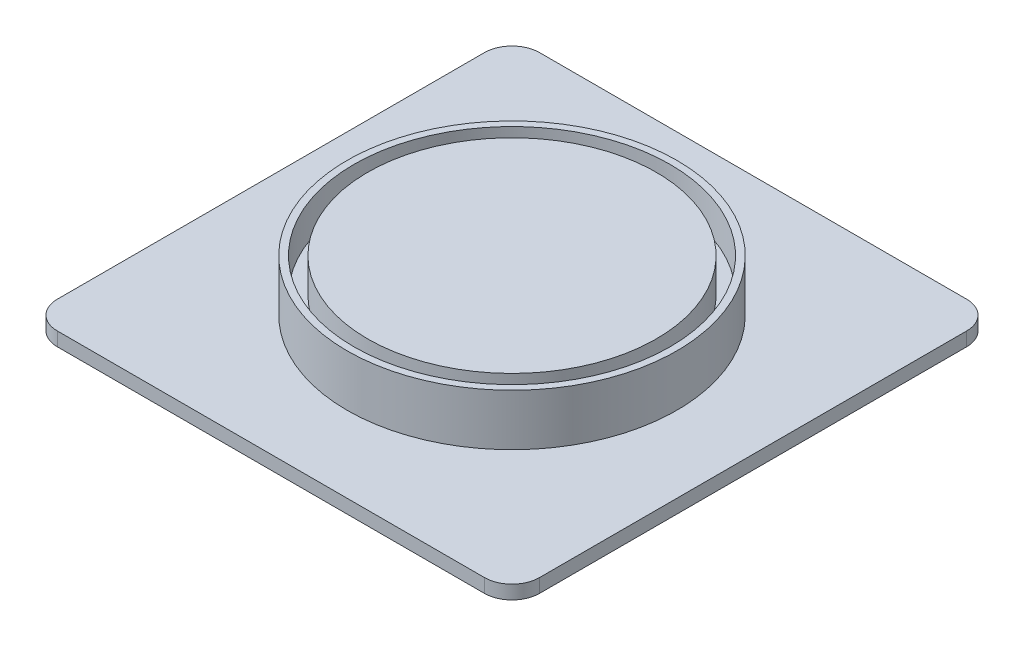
ISO-10303-21;
HEADER;
FILE_DESCRIPTION(('STEP AP214'),'2;1');
FILE_NAME('part.step','',(''),(''),'','','');
FILE_SCHEMA(('AUTOMOTIVE_DESIGN { 1 0 10303 214 1 1 1 1 }'));
ENDSEC;
DATA;
#1=APPLICATION_CONTEXT('core data for automotive mechanical design processes');
#2=APPLICATION_PROTOCOL_DEFINITION('international standard','automotive_design',2000,#1);
#3=PRODUCT_CONTEXT('',#1,'mechanical');
#4=PRODUCT('Part','Part','',(#3));
#5=PRODUCT_RELATED_PRODUCT_CATEGORY('part','',(#4));
#6=PRODUCT_DEFINITION_FORMATION('','',#4);
#7=PRODUCT_DEFINITION_CONTEXT('part definition',#1,'design');
#8=PRODUCT_DEFINITION('design','',#6,#7);
#9=PRODUCT_DEFINITION_SHAPE('','',#8);
#10=(LENGTH_UNIT() NAMED_UNIT(*) SI_UNIT(.MILLI.,.METRE.));
#11=(NAMED_UNIT(*) PLANE_ANGLE_UNIT() SI_UNIT($,.RADIAN.));
#12=(NAMED_UNIT(*) SI_UNIT($,.STERADIAN.) SOLID_ANGLE_UNIT());
#13=UNCERTAINTY_MEASURE_WITH_UNIT(LENGTH_MEASURE(1.E-05),#10,'distance_accuracy_value','');
#14=(GEOMETRIC_REPRESENTATION_CONTEXT(3) GLOBAL_UNCERTAINTY_ASSIGNED_CONTEXT((#13)) GLOBAL_UNIT_ASSIGNED_CONTEXT((#10,
#11,#12)) REPRESENTATION_CONTEXT('',''));
#15=CARTESIAN_POINT('',(0.,0.,0.));
#16=DIRECTION('',(0.,0.,1.));
#17=DIRECTION('',(1.,0.,0.));
#18=AXIS2_PLACEMENT_3D('',#15,#16,#17);
#19=CARTESIAN_POINT('',(0.,37.4682,0.));
#20=DIRECTION('',(0.,-1.,0.));
#21=DIRECTION('',(0.,0.,-1.));
#22=AXIS2_PLACEMENT_3D('',#19,#20,#21);
#23=CYLINDRICAL_SURFACE('',#22,120.);
#24=CARTESIAN_POINT('',(0.,37.4682,0.));
#25=DIRECTION('',(0.,1.,0.));
#26=DIRECTION('',(0.,0.,1.));
#27=AXIS2_PLACEMENT_3D('',#24,#25,#26);
#28=CIRCLE('',#27,120.);
#29=CARTESIAN_POINT('',(0.,37.4682,120.));
#30=VERTEX_POINT('',#29);
#31=EDGE_CURVE('E125',#30,#30,#28,.T.);
#32=ORIENTED_EDGE('',*,*,#31,.F.);
#33=EDGE_LOOP('',(#32));
#34=FACE_BOUND('',#33,.T.);
#35=CARTESIAN_POINT('',(0.,0.,0.));
#36=DIRECTION('',(0.,-1.,0.));
#37=DIRECTION('',(0.,0.,-1.));
#38=AXIS2_PLACEMENT_3D('',#35,#36,#37);
#39=CIRCLE('',#38,120.);
#40=CARTESIAN_POINT('',(0.,0.,-120.));
#41=VERTEX_POINT('',#40);
#42=EDGE_CURVE('E129',#41,#41,#39,.T.);
#43=ORIENTED_EDGE('',*,*,#42,.F.);
#44=EDGE_LOOP('',(#43));
#45=FACE_BOUND('',#44,.T.);
#46=ADVANCED_FACE('F34',(#34,#45),#23,.T.);
#47=CARTESIAN_POINT('',(0.,37.4682,0.));
#48=DIRECTION('',(0.,1.,0.));
#49=DIRECTION('',(0.,0.,1.));
#50=AXIS2_PLACEMENT_3D('',#47,#48,#49);
#51=PLANE('',#50);
#52=CARTESIAN_POINT('',(0.,37.4682,0.));
#53=DIRECTION('',(0.,1.,0.));
#54=DIRECTION('',(0.,0.,1.));
#55=AXIS2_PLACEMENT_3D('',#52,#53,#54);
#56=CIRCLE('',#55,115.);
#57=CARTESIAN_POINT('',(0.,37.4682,115.));
#58=VERTEX_POINT('',#57);
#59=EDGE_CURVE('E214',#58,#58,#56,.T.);
#60=ORIENTED_EDGE('',*,*,#59,.F.);
#61=EDGE_LOOP('',(#60));
#62=FACE_BOUND('',#61,.T.);
#63=ORIENTED_EDGE('',*,*,#31,.T.);
#64=EDGE_LOOP('',(#63));
#65=FACE_BOUND('',#64,.T.);
#66=ADVANCED_FACE('F175',(#62,#65),#51,.T.);
#67=CARTESIAN_POINT('',(175.4,0.,-175.4));
#68=DIRECTION('',(0.,-1.,0.));
#69=DIRECTION('',(0.,0.,-1.));
#70=AXIS2_PLACEMENT_3D('',#67,#68,#69);
#71=PLANE('',#70);
#72=DIRECTION('',(1.,0.,0.));
#73=VECTOR('',#72,1.);
#74=CARTESIAN_POINT('',(-175.4,0.,175.4));
#75=LINE('',#74,#73);
#76=CARTESIAN_POINT('',(-155.4,0.,175.4));
#77=VERTEX_POINT('',#76);
#78=CARTESIAN_POINT('',(155.4,0.,175.4));
#79=VERTEX_POINT('',#78);
#80=EDGE_CURVE('E104',#77,#79,#75,.T.);
#81=ORIENTED_EDGE('',*,*,#80,.T.);
#82=CARTESIAN_POINT('',(155.4,0.,155.4));
#83=DIRECTION('',(0.,-1.,0.));
#84=DIRECTION('',(0.,0.,-1.));
#85=AXIS2_PLACEMENT_3D('',#82,#83,#84);
#86=CIRCLE('',#85,20.);
#87=CARTESIAN_POINT('',(175.4,0.,155.4));
#88=VERTEX_POINT('',#87);
#89=EDGE_CURVE('E136',#79,#88,#86,.F.);
#90=ORIENTED_EDGE('',*,*,#89,.T.);
#91=DIRECTION('',(0.,0.,-1.));
#92=VECTOR('',#91,1.);
#93=CARTESIAN_POINT('',(175.4,0.,175.4));
#94=LINE('',#93,#92);
#95=CARTESIAN_POINT('',(175.4,0.,-155.4));
#96=VERTEX_POINT('',#95);
#97=EDGE_CURVE('E164',#88,#96,#94,.T.);
#98=ORIENTED_EDGE('',*,*,#97,.T.);
#99=CARTESIAN_POINT('',(155.4,0.,-155.4));
#100=DIRECTION('',(0.,-1.,0.));
#101=DIRECTION('',(0.,0.,-1.));
#102=AXIS2_PLACEMENT_3D('',#99,#100,#101);
#103=CIRCLE('',#102,20.);
#104=CARTESIAN_POINT('',(155.4,0.,-175.4));
#105=VERTEX_POINT('',#104);
#106=EDGE_CURVE('E134',#96,#105,#103,.F.);
#107=ORIENTED_EDGE('',*,*,#106,.T.);
#108=DIRECTION('',(-1.,0.,0.));
#109=VECTOR('',#108,1.);
#110=CARTESIAN_POINT('',(-175.4,0.,-175.4));
#111=LINE('',#110,#109);
#112=CARTESIAN_POINT('',(-155.4,0.,-175.4));
#113=VERTEX_POINT('',#112);
#114=EDGE_CURVE('E167',#105,#113,#111,.T.);
#115=ORIENTED_EDGE('',*,*,#114,.T.);
#116=CARTESIAN_POINT('',(-155.4,0.,-155.4));
#117=DIRECTION('',(0.,-1.,0.));
#118=DIRECTION('',(0.,0.,-1.));
#119=AXIS2_PLACEMENT_3D('',#116,#117,#118);
#120=CIRCLE('',#119,20.);
#121=CARTESIAN_POINT('',(-175.4,0.,-155.4));
#122=VERTEX_POINT('',#121);
#123=EDGE_CURVE('E111',#113,#122,#120,.F.);
#124=ORIENTED_EDGE('',*,*,#123,.T.);
#125=DIRECTION('',(0.,0.,1.));
#126=VECTOR('',#125,1.);
#127=CARTESIAN_POINT('',(-175.4,0.,175.4));
#128=LINE('',#127,#126);
#129=CARTESIAN_POINT('',(-175.4,0.,155.4));
#130=VERTEX_POINT('',#129);
#131=EDGE_CURVE('E106',#122,#130,#128,.T.);
#132=ORIENTED_EDGE('',*,*,#131,.T.);
#133=CARTESIAN_POINT('',(-155.4,0.,155.4));
#134=DIRECTION('',(0.,-1.,0.));
#135=DIRECTION('',(0.,0.,-1.));
#136=AXIS2_PLACEMENT_3D('',#133,#134,#135);
#137=CIRCLE('',#136,20.);
#138=EDGE_CURVE('E100',#130,#77,#137,.F.);
#139=ORIENTED_EDGE('',*,*,#138,.T.);
#140=EDGE_LOOP('',(#81,#90,#98,#107,#115,#124,#132,#139));
#141=FACE_BOUND('',#140,.T.);
#142=ORIENTED_EDGE('',*,*,#42,.T.);
#143=EDGE_LOOP('',(#142));
#144=FACE_BOUND('',#143,.T.);
#145=ADVANCED_FACE('F102',(#141,#144),#71,.F.);
#146=CARTESIAN_POINT('',(175.4,-10.,175.4));
#147=DIRECTION('',(1.,0.,0.));
#148=DIRECTION('',(0.,0.,-1.));
#149=AXIS2_PLACEMENT_3D('',#146,#147,#148);
#150=PLANE('',#149);
#151=ORIENTED_EDGE('',*,*,#97,.F.);
#152=DIRECTION('',(0.,1.,0.));
#153=VECTOR('',#152,1.);
#154=CARTESIAN_POINT('',(175.4,-10.,155.4));
#155=LINE('',#154,#153);
#156=CARTESIAN_POINT('',(175.4,-10.,155.4));
#157=VERTEX_POINT('',#156);
#158=EDGE_CURVE('E141',#88,#157,#155,.F.);
#159=ORIENTED_EDGE('',*,*,#158,.T.);
#160=DIRECTION('',(0.,0.,-1.));
#161=VECTOR('',#160,1.);
#162=CARTESIAN_POINT('',(175.4,-10.,175.4));
#163=LINE('',#162,#161);
#164=CARTESIAN_POINT('',(175.4,-10.,-155.4));
#165=VERTEX_POINT('',#164);
#166=EDGE_CURVE('E121',#157,#165,#163,.T.);
#167=ORIENTED_EDGE('',*,*,#166,.T.);
#168=DIRECTION('',(0.,1.,0.));
#169=VECTOR('',#168,1.);
#170=CARTESIAN_POINT('',(175.4,-10.,-155.4));
#171=LINE('',#170,#169);
#172=EDGE_CURVE('E138',#165,#96,#171,.T.);
#173=ORIENTED_EDGE('',*,*,#172,.T.);
#174=EDGE_LOOP('',(#151,#159,#167,#173));
#175=FACE_BOUND('',#174,.T.);
#176=ADVANCED_FACE('F209',(#175),#150,.T.);
#177=CARTESIAN_POINT('',(-175.4,-10.,175.4));
#178=DIRECTION('',(0.,0.,1.));
#179=DIRECTION('',(1.,0.,0.));
#180=AXIS2_PLACEMENT_3D('',#177,#178,#179);
#181=PLANE('',#180);
#182=DIRECTION('',(1.,0.,0.));
#183=VECTOR('',#182,1.);
#184=CARTESIAN_POINT('',(-175.4,-10.,175.4));
#185=LINE('',#184,#183);
#186=CARTESIAN_POINT('',(-155.4,-10.,175.4));
#187=VERTEX_POINT('',#186);
#188=CARTESIAN_POINT('',(155.4,-10.,175.4));
#189=VERTEX_POINT('',#188);
#190=EDGE_CURVE('E157',#187,#189,#185,.T.);
#191=ORIENTED_EDGE('',*,*,#190,.T.);
#192=DIRECTION('',(0.,1.,0.));
#193=VECTOR('',#192,1.);
#194=CARTESIAN_POINT('',(155.4,-10.,175.4));
#195=LINE('',#194,#193);
#196=EDGE_CURVE('E112',#189,#79,#195,.T.);
#197=ORIENTED_EDGE('',*,*,#196,.T.);
#198=ORIENTED_EDGE('',*,*,#80,.F.);
#199=DIRECTION('',(0.,1.,0.));
#200=VECTOR('',#199,1.);
#201=CARTESIAN_POINT('',(-155.4,-10.,175.4));
#202=LINE('',#201,#200);
#203=EDGE_CURVE('E118',#77,#187,#202,.F.);
#204=ORIENTED_EDGE('',*,*,#203,.T.);
#205=EDGE_LOOP('',(#191,#197,#198,#204));
#206=FACE_BOUND('',#205,.T.);
#207=ADVANCED_FACE('F117',(#206),#181,.T.);
#208=CARTESIAN_POINT('',(-175.4,-10.,175.4));
#209=DIRECTION('',(-1.,0.,0.));
#210=DIRECTION('',(0.,0.,1.));
#211=AXIS2_PLACEMENT_3D('',#208,#209,#210);
#212=PLANE('',#211);
#213=ORIENTED_EDGE('',*,*,#131,.F.);
#214=DIRECTION('',(0.,1.,0.));
#215=VECTOR('',#214,1.);
#216=CARTESIAN_POINT('',(-175.4,-10.,-155.4));
#217=LINE('',#216,#215);
#218=CARTESIAN_POINT('',(-175.4,-10.,-155.4));
#219=VERTEX_POINT('',#218);
#220=EDGE_CURVE('E11',#122,#219,#217,.F.);
#221=ORIENTED_EDGE('',*,*,#220,.T.);
#222=DIRECTION('',(0.,0.,1.));
#223=VECTOR('',#222,1.);
#224=CARTESIAN_POINT('',(-175.4,-10.,175.4));
#225=LINE('',#224,#223);
#226=CARTESIAN_POINT('',(-175.4,-10.,155.4));
#227=VERTEX_POINT('',#226);
#228=EDGE_CURVE('E156',#219,#227,#225,.T.);
#229=ORIENTED_EDGE('',*,*,#228,.T.);
#230=DIRECTION('',(0.,1.,0.));
#231=VECTOR('',#230,1.);
#232=CARTESIAN_POINT('',(-175.4,-10.,155.4));
#233=LINE('',#232,#231);
#234=EDGE_CURVE('E42',#227,#130,#233,.T.);
#235=ORIENTED_EDGE('',*,*,#234,.T.);
#236=EDGE_LOOP('',(#213,#221,#229,#235));
#237=FACE_BOUND('',#236,.T.);
#238=ADVANCED_FACE('F154',(#237),#212,.T.);
#239=CARTESIAN_POINT('',(-175.4,-10.,-175.4));
#240=DIRECTION('',(0.,0.,-1.));
#241=DIRECTION('',(-1.,0.,0.));
#242=AXIS2_PLACEMENT_3D('',#239,#240,#241);
#243=PLANE('',#242);
#244=ORIENTED_EDGE('',*,*,#114,.F.);
#245=DIRECTION('',(0.,1.,0.));
#246=VECTOR('',#245,1.);
#247=CARTESIAN_POINT('',(155.4,-10.,-175.4));
#248=LINE('',#247,#246);
#249=CARTESIAN_POINT('',(155.4,-10.,-175.4));
#250=VERTEX_POINT('',#249);
#251=EDGE_CURVE('E56',#105,#250,#248,.F.);
#252=ORIENTED_EDGE('',*,*,#251,.T.);
#253=DIRECTION('',(-1.,0.,0.));
#254=VECTOR('',#253,1.);
#255=CARTESIAN_POINT('',(-175.4,-10.,-175.4));
#256=LINE('',#255,#254);
#257=CARTESIAN_POINT('',(-155.4,-10.,-175.4));
#258=VERTEX_POINT('',#257);
#259=EDGE_CURVE('E158',#250,#258,#256,.T.);
#260=ORIENTED_EDGE('',*,*,#259,.T.);
#261=DIRECTION('',(0.,1.,0.));
#262=VECTOR('',#261,1.);
#263=CARTESIAN_POINT('',(-155.4,-10.,-175.4));
#264=LINE('',#263,#262);
#265=EDGE_CURVE('E149',#258,#113,#264,.T.);
#266=ORIENTED_EDGE('',*,*,#265,.T.);
#267=EDGE_LOOP('',(#244,#252,#260,#266));
#268=FACE_BOUND('',#267,.T.);
#269=ADVANCED_FACE('F203',(#268),#243,.T.);
#270=CARTESIAN_POINT('',(175.4,-10.,-175.4));
#271=DIRECTION('',(0.,-1.,0.));
#272=DIRECTION('',(0.,0.,-1.));
#273=AXIS2_PLACEMENT_3D('',#270,#271,#272);
#274=PLANE('',#273);
#275=ORIENTED_EDGE('',*,*,#166,.F.);
#276=CARTESIAN_POINT('',(155.4,-10.,155.4));
#277=DIRECTION('',(0.,-1.,0.));
#278=DIRECTION('',(0.,0.,-1.));
#279=AXIS2_PLACEMENT_3D('',#276,#277,#278);
#280=CIRCLE('',#279,20.);
#281=EDGE_CURVE('E147',#157,#189,#280,.T.);
#282=ORIENTED_EDGE('',*,*,#281,.T.);
#283=ORIENTED_EDGE('',*,*,#190,.F.);
#284=CARTESIAN_POINT('',(-155.4,-10.,155.4));
#285=DIRECTION('',(0.,-1.,0.));
#286=DIRECTION('',(0.,0.,-1.));
#287=AXIS2_PLACEMENT_3D('',#284,#285,#286);
#288=CIRCLE('',#287,20.);
#289=EDGE_CURVE('E124',#187,#227,#288,.T.);
#290=ORIENTED_EDGE('',*,*,#289,.T.);
#291=ORIENTED_EDGE('',*,*,#228,.F.);
#292=CARTESIAN_POINT('',(-155.4,-10.,-155.4));
#293=DIRECTION('',(0.,-1.,0.));
#294=DIRECTION('',(0.,0.,-1.));
#295=AXIS2_PLACEMENT_3D('',#292,#293,#294);
#296=CIRCLE('',#295,20.);
#297=EDGE_CURVE('E49',#219,#258,#296,.T.);
#298=ORIENTED_EDGE('',*,*,#297,.T.);
#299=ORIENTED_EDGE('',*,*,#259,.F.);
#300=CARTESIAN_POINT('',(155.4,-10.,-155.4));
#301=DIRECTION('',(0.,-1.,0.));
#302=DIRECTION('',(0.,0.,-1.));
#303=AXIS2_PLACEMENT_3D('',#300,#301,#302);
#304=CIRCLE('',#303,20.);
#305=EDGE_CURVE('E145',#250,#165,#304,.T.);
#306=ORIENTED_EDGE('',*,*,#305,.T.);
#307=EDGE_LOOP('',(#275,#282,#283,#290,#291,#298,#299,#306));
#308=FACE_BOUND('',#307,.T.);
#309=ADVANCED_FACE('F191',(#308),#274,.T.);
#310=CARTESIAN_POINT('',(155.4,-10.,155.4));
#311=DIRECTION('',(0.,1.,0.));
#312=DIRECTION('',(0.,0.,1.));
#313=AXIS2_PLACEMENT_3D('',#310,#311,#312);
#314=CYLINDRICAL_SURFACE('',#313,20.);
#315=ORIENTED_EDGE('',*,*,#281,.F.);
#316=ORIENTED_EDGE('',*,*,#158,.F.);
#317=ORIENTED_EDGE('',*,*,#89,.F.);
#318=ORIENTED_EDGE('',*,*,#196,.F.);
#319=EDGE_LOOP('',(#315,#316,#317,#318));
#320=FACE_BOUND('',#319,.T.);
#321=ADVANCED_FACE('F187',(#320),#314,.T.);
#322=CARTESIAN_POINT('',(155.4,-10.,-155.4));
#323=DIRECTION('',(0.,1.,0.));
#324=DIRECTION('',(0.,0.,1.));
#325=AXIS2_PLACEMENT_3D('',#322,#323,#324);
#326=CYLINDRICAL_SURFACE('',#325,20.);
#327=ORIENTED_EDGE('',*,*,#305,.F.);
#328=ORIENTED_EDGE('',*,*,#251,.F.);
#329=ORIENTED_EDGE('',*,*,#106,.F.);
#330=ORIENTED_EDGE('',*,*,#172,.F.);
#331=EDGE_LOOP('',(#327,#328,#329,#330));
#332=FACE_BOUND('',#331,.T.);
#333=ADVANCED_FACE('F190',(#332),#326,.T.);
#334=CARTESIAN_POINT('',(-155.4,-10.,-155.4));
#335=DIRECTION('',(0.,1.,0.));
#336=DIRECTION('',(0.,0.,1.));
#337=AXIS2_PLACEMENT_3D('',#334,#335,#336);
#338=CYLINDRICAL_SURFACE('',#337,20.);
#339=ORIENTED_EDGE('',*,*,#297,.F.);
#340=ORIENTED_EDGE('',*,*,#220,.F.);
#341=ORIENTED_EDGE('',*,*,#123,.F.);
#342=ORIENTED_EDGE('',*,*,#265,.F.);
#343=EDGE_LOOP('',(#339,#340,#341,#342));
#344=FACE_BOUND('',#343,.T.);
#345=ADVANCED_FACE('F194',(#344),#338,.T.);
#346=CARTESIAN_POINT('',(-155.4,-10.,155.4));
#347=DIRECTION('',(0.,1.,0.));
#348=DIRECTION('',(0.,0.,1.));
#349=AXIS2_PLACEMENT_3D('',#346,#347,#348);
#350=CYLINDRICAL_SURFACE('',#349,20.);
#351=ORIENTED_EDGE('',*,*,#289,.F.);
#352=ORIENTED_EDGE('',*,*,#203,.F.);
#353=ORIENTED_EDGE('',*,*,#138,.F.);
#354=ORIENTED_EDGE('',*,*,#234,.F.);
#355=EDGE_LOOP('',(#351,#352,#353,#354));
#356=FACE_BOUND('',#355,.T.);
#357=ADVANCED_FACE('F36',(#356),#350,.T.);
#358=CARTESIAN_POINT('',(0.,12.4682,0.));
#359=DIRECTION('',(0.,1.,0.));
#360=DIRECTION('',(0.,0.,1.));
#361=AXIS2_PLACEMENT_3D('',#358,#359,#360);
#362=CYLINDRICAL_SURFACE('',#361,115.);
#363=CARTESIAN_POINT('',(0.,12.4682,0.));
#364=DIRECTION('',(0.,1.,0.));
#365=DIRECTION('',(0.,0.,1.));
#366=AXIS2_PLACEMENT_3D('',#363,#364,#365);
#367=CIRCLE('',#366,115.);
#368=CARTESIAN_POINT('',(0.,12.4682,115.));
#369=VERTEX_POINT('',#368);
#370=EDGE_CURVE('E168',#369,#369,#367,.T.);
#371=ORIENTED_EDGE('',*,*,#370,.F.);
#372=EDGE_LOOP('',(#371));
#373=FACE_BOUND('',#372,.T.);
#374=ORIENTED_EDGE('',*,*,#59,.T.);
#375=EDGE_LOOP('',(#374));
#376=FACE_BOUND('',#375,.T.);
#377=ADVANCED_FACE('F201',(#373,#376),#362,.F.);
#378=CARTESIAN_POINT('',(0.,12.4682,0.));
#379=DIRECTION('',(0.,1.,0.));
#380=DIRECTION('',(0.,0.,1.));
#381=AXIS2_PLACEMENT_3D('',#378,#379,#380);
#382=PLANE('',#381);
#383=CARTESIAN_POINT('',(0.,12.4682,0.));
#384=DIRECTION('',(0.,1.,0.));
#385=DIRECTION('',(0.,0.,1.));
#386=AXIS2_PLACEMENT_3D('',#383,#384,#385);
#387=CIRCLE('',#386,105.);
#388=CARTESIAN_POINT('',(0.,12.4682,105.));
#389=VERTEX_POINT('',#388);
#390=EDGE_CURVE('E217',#389,#389,#387,.T.);
#391=ORIENTED_EDGE('',*,*,#390,.F.);
#392=EDGE_LOOP('',(#391));
#393=FACE_BOUND('',#392,.T.);
#394=ORIENTED_EDGE('',*,*,#370,.T.);
#395=EDGE_LOOP('',(#394));
#396=FACE_BOUND('',#395,.T.);
#397=ADVANCED_FACE('F229',(#393,#396),#382,.T.);
#398=CARTESIAN_POINT('',(0.,12.4682,0.));
#399=DIRECTION('',(0.,1.,0.));
#400=DIRECTION('',(0.,0.,1.));
#401=AXIS2_PLACEMENT_3D('',#398,#399,#400);
#402=CYLINDRICAL_SURFACE('',#401,105.);
#403=ORIENTED_EDGE('',*,*,#390,.T.);
#404=EDGE_LOOP('',(#403));
#405=FACE_BOUND('',#404,.T.);
#406=CARTESIAN_POINT('',(0.,37.4682,0.));
#407=DIRECTION('',(0.,1.,0.));
#408=DIRECTION('',(0.,0.,1.));
#409=AXIS2_PLACEMENT_3D('',#406,#407,#408);
#410=CIRCLE('',#409,105.);
#411=CARTESIAN_POINT('',(0.,37.4682,105.));
#412=VERTEX_POINT('',#411);
#413=EDGE_CURVE('E220',#412,#412,#410,.T.);
#414=ORIENTED_EDGE('',*,*,#413,.F.);
#415=EDGE_LOOP('',(#414));
#416=FACE_BOUND('',#415,.T.);
#417=ADVANCED_FACE('F226',(#405,#416),#402,.T.);
#418=ORIENTED_EDGE('',*,*,#413,.T.);
#419=EDGE_LOOP('',(#418));
#420=FACE_BOUND('',#419,.T.);
#421=ADVANCED_FACE('F183',(#420),#51,.T.);
#422=CLOSED_SHELL('',(#46,#66,#145,#176,#207,#238,#269,#309,#321,#333,#345,#357,#377,#397,#417,#421));
#423=MANIFOLD_SOLID_BREP('B2',#422);
#424=ADVANCED_BREP_SHAPE_REPRESENTATION('',(#18,#423),#14);
#425=SHAPE_DEFINITION_REPRESENTATION(#9,#424);
ENDSEC;
END-ISO-10303-21;
